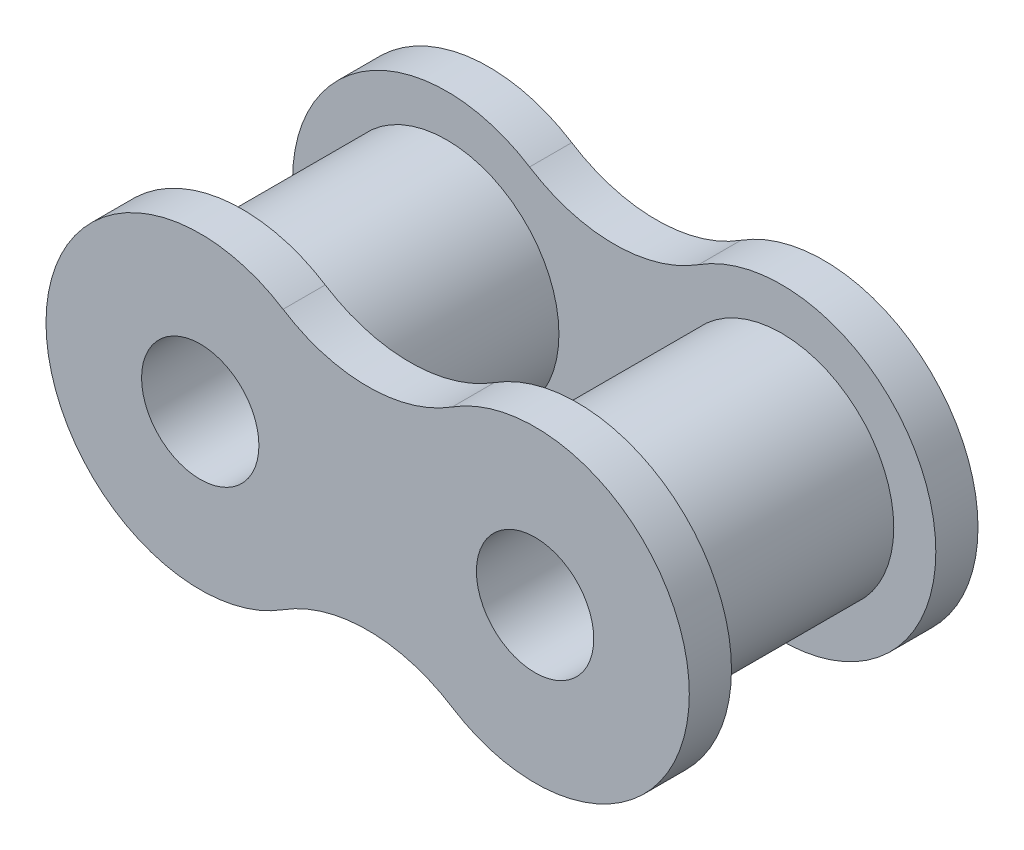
from build123d import *

# Parameters (mm, degrees)
SKETCH1_R             = 4.255
SKETCH1_R_2           = 2.225
BOSS_EXTRUDE1_DEPTH   = 3.875
BOSS_EXTRUDE1_2_DEPTH = 3.875
SKETCH2_R             = 2.225
BOSS_EXTRUDE2_DEPTH   = 1.6
BOSS_EXTRUDE3_START   = 1.6
SKETCH3_R             = 2.225
BOSS_EXTRUDE3_DEPTH   = 1.6


with BuildPart() as part:
    # Sketch1 → Boss-Extrude1 (new, symmetric)
    with BuildSketch(Plane.XY):
        Circle(SKETCH1_R)
        Circle(SKETCH1_R_2, mode=Mode.SUBTRACT)
    extrude(amount=BOSS_EXTRUDE1_DEPTH, both=True)



with BuildPart() as body_2:
    # Sketch1 → Boss-Extrude1 2 (new, symmetric)
    with BuildSketch(Plane.XY):
        with Locations((-12.7, 0)):
            Circle(SKETCH1_R)
        with Locations((-12.7, 0)):
            Circle(SKETCH1_R_2, mode=Mode.SUBTRACT)
    extrude(amount=BOSS_EXTRUDE1_2_DEPTH, both=True)


with BuildPart() as part_1:
    add(part.part)

    add(body_2.part)  # Boss-Extrude2 merges body 2
    # Sketch2 → Boss-Extrude2 (add)
    with BuildSketch(Plane.XY.offset(3.875)):
        with BuildLine():
            ThreePointArc((-3.141969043, -4.934625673), (5.85, 0), (-3.141969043, 4.934625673))
            ThreePointArc((-3.141969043, 4.934625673), (-6.35, 4.000005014), (-9.558030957, 4.934625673))
            ThreePointArc((-9.558030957, 4.934625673), (-18.55, 0), (-9.558030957, -4.934625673))
            ThreePointArc((-9.558030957, -4.934625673), (-6.35, -4.000005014), (-3.141969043, -4.934625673))
        make_face()
        Circle(SKETCH2_R, mode=Mode.SUBTRACT)
        with Locations((-12.7, 0)):
            Circle(SKETCH2_R, mode=Mode.SUBTRACT)
    extrude(amount=BOSS_EXTRUDE2_DEPTH)

    # Sketch3 → Boss-Extrude3 (add)
    with BuildSketch(Plane(origin=(0, 0, -3.875), x_dir=(-1, 0, 0), z_dir=(0, 0, -1)).offset(BOSS_EXTRUDE3_START)):
        with BuildLine():
            ThreePointArc((3.141969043, 4.934625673), (-5.85, 0), (3.141969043, -4.934625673))
            ThreePointArc((3.141969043, -4.934625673), (6.35, -4.000005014), (9.558030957, -4.934625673))
            ThreePointArc((9.558030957, -4.934625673), (18.55, 0), (9.558030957, 4.934625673))
            ThreePointArc((9.558030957, 4.934625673), (6.35, 4.000005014), (3.141969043, 4.934625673))
        make_face()
        Circle(SKETCH3_R, mode=Mode.SUBTRACT)
        with Locations((12.7, 0)):
            Circle(SKETCH3_R, mode=Mode.SUBTRACT)
    extrude(amount=-BOSS_EXTRUDE3_DEPTH)


solid = part_1.part
